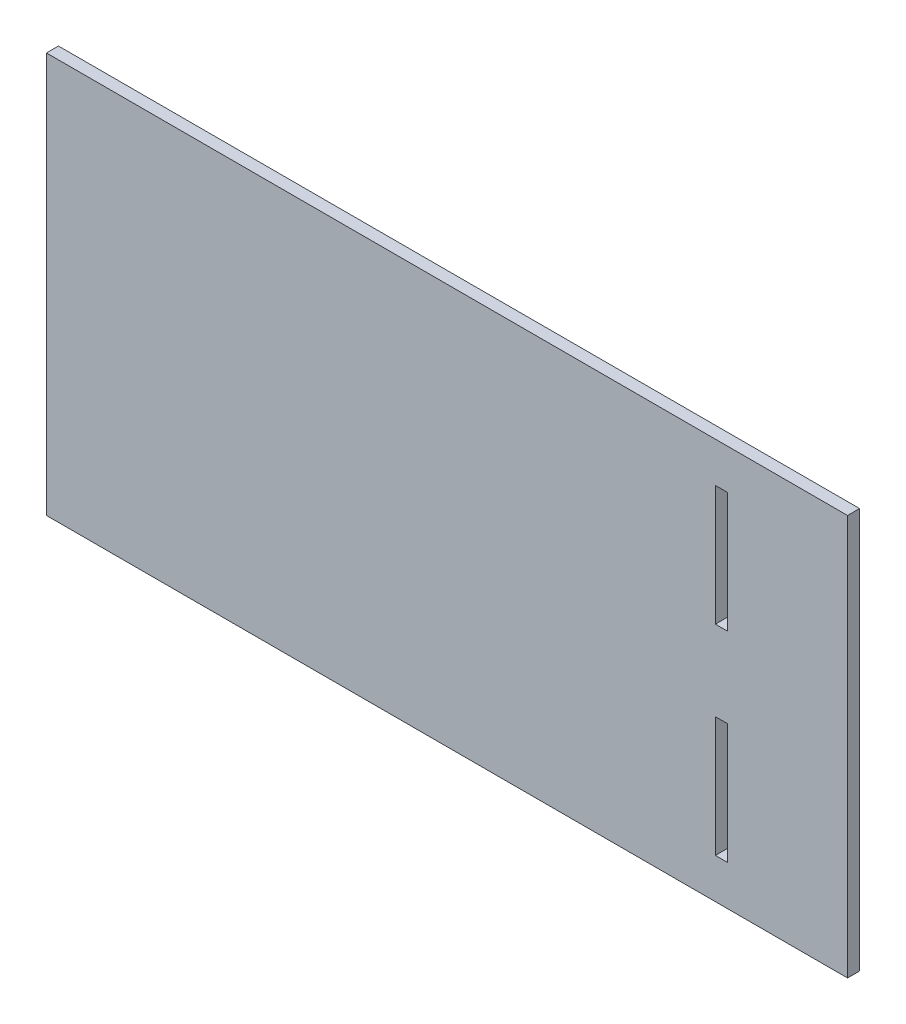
ISO-10303-21;
HEADER;
FILE_DESCRIPTION(('STEP AP214'),'2;1');
FILE_NAME('part.step','',(''),(''),'','','');
FILE_SCHEMA(('AUTOMOTIVE_DESIGN { 1 0 10303 214 1 1 1 1 }'));
ENDSEC;
DATA;
#1=APPLICATION_CONTEXT('core data for automotive mechanical design processes');
#2=APPLICATION_PROTOCOL_DEFINITION('international standard','automotive_design',2000,#1);
#3=PRODUCT_CONTEXT('',#1,'mechanical');
#4=PRODUCT('Part','Part','',(#3));
#5=PRODUCT_RELATED_PRODUCT_CATEGORY('part','',(#4));
#6=PRODUCT_DEFINITION_FORMATION('','',#4);
#7=PRODUCT_DEFINITION_CONTEXT('part definition',#1,'design');
#8=PRODUCT_DEFINITION('design','',#6,#7);
#9=PRODUCT_DEFINITION_SHAPE('','',#8);
#10=(LENGTH_UNIT() NAMED_UNIT(*) SI_UNIT(.MILLI.,.METRE.));
#11=(NAMED_UNIT(*) PLANE_ANGLE_UNIT() SI_UNIT($,.RADIAN.));
#12=(NAMED_UNIT(*) SI_UNIT($,.STERADIAN.) SOLID_ANGLE_UNIT());
#13=UNCERTAINTY_MEASURE_WITH_UNIT(LENGTH_MEASURE(1.E-05),#10,'distance_accuracy_value','');
#14=(GEOMETRIC_REPRESENTATION_CONTEXT(3) GLOBAL_UNCERTAINTY_ASSIGNED_CONTEXT((#13)) GLOBAL_UNIT_ASSIGNED_CONTEXT((#10,
#11,#12)) REPRESENTATION_CONTEXT('',''));
#15=CARTESIAN_POINT('',(0.,0.,0.));
#16=DIRECTION('',(0.,0.,1.));
#17=DIRECTION('',(1.,0.,0.));
#18=AXIS2_PLACEMENT_3D('',#15,#16,#17);
#19=CARTESIAN_POINT('',(100.,-50.,3.));
#20=DIRECTION('',(-1.,0.,0.));
#21=DIRECTION('',(0.,0.,1.));
#22=AXIS2_PLACEMENT_3D('',#19,#20,#21);
#23=PLANE('',#22);
#24=DIRECTION('',(0.,1.,0.));
#25=VECTOR('',#24,1.);
#26=CARTESIAN_POINT('',(100.,-50.,0.));
#27=LINE('',#26,#25);
#28=CARTESIAN_POINT('',(100.,-50.,0.));
#29=VERTEX_POINT('',#28);
#30=CARTESIAN_POINT('',(100.,50.,0.));
#31=VERTEX_POINT('',#30);
#32=EDGE_CURVE('E183',#29,#31,#27,.T.);
#33=ORIENTED_EDGE('',*,*,#32,.T.);
#34=DIRECTION('',(0.,0.,-1.));
#35=VECTOR('',#34,1.);
#36=CARTESIAN_POINT('',(100.,50.,3.));
#37=LINE('',#36,#35);
#38=CARTESIAN_POINT('',(100.,50.,3.));
#39=VERTEX_POINT('',#38);
#40=EDGE_CURVE('E11',#39,#31,#37,.T.);
#41=ORIENTED_EDGE('',*,*,#40,.F.);
#42=DIRECTION('',(0.,1.,0.));
#43=VECTOR('',#42,1.);
#44=CARTESIAN_POINT('',(100.,-50.,3.));
#45=LINE('',#44,#43);
#46=CARTESIAN_POINT('',(100.,-50.,3.));
#47=VERTEX_POINT('',#46);
#48=EDGE_CURVE('E190',#47,#39,#45,.T.);
#49=ORIENTED_EDGE('',*,*,#48,.F.);
#50=DIRECTION('',(0.,0.,-1.));
#51=VECTOR('',#50,1.);
#52=CARTESIAN_POINT('',(100.,-50.,3.));
#53=LINE('',#52,#51);
#54=EDGE_CURVE('E200',#47,#29,#53,.T.);
#55=ORIENTED_EDGE('',*,*,#54,.T.);
#56=EDGE_LOOP('',(#33,#41,#49,#55));
#57=FACE_BOUND('',#56,.T.);
#58=ADVANCED_FACE('F33',(#57),#23,.F.);
#59=CARTESIAN_POINT('',(-100.,50.,3.));
#60=DIRECTION('',(0.,-1.,0.));
#61=DIRECTION('',(0.,0.,-1.));
#62=AXIS2_PLACEMENT_3D('',#59,#60,#61);
#63=PLANE('',#62);
#64=DIRECTION('',(-1.,0.,0.));
#65=VECTOR('',#64,1.);
#66=CARTESIAN_POINT('',(-100.,50.,0.));
#67=LINE('',#66,#65);
#68=CARTESIAN_POINT('',(-100.,50.,0.));
#69=VERTEX_POINT('',#68);
#70=EDGE_CURVE('E203',#31,#69,#67,.T.);
#71=ORIENTED_EDGE('',*,*,#70,.T.);
#72=DIRECTION('',(0.,0.,-1.));
#73=VECTOR('',#72,1.);
#74=CARTESIAN_POINT('',(-100.,50.,3.));
#75=LINE('',#74,#73);
#76=CARTESIAN_POINT('',(-100.,50.,3.));
#77=VERTEX_POINT('',#76);
#78=EDGE_CURVE('E40',#77,#69,#75,.T.);
#79=ORIENTED_EDGE('',*,*,#78,.F.);
#80=DIRECTION('',(-1.,0.,0.));
#81=VECTOR('',#80,1.);
#82=CARTESIAN_POINT('',(-100.,50.,3.));
#83=LINE('',#82,#81);
#84=EDGE_CURVE('E193',#39,#77,#83,.T.);
#85=ORIENTED_EDGE('',*,*,#84,.F.);
#86=ORIENTED_EDGE('',*,*,#40,.T.);
#87=EDGE_LOOP('',(#71,#79,#85,#86));
#88=FACE_BOUND('',#87,.T.);
#89=ADVANCED_FACE('F232',(#88),#63,.F.);
#90=CARTESIAN_POINT('',(-100.,-50.,3.));
#91=DIRECTION('',(1.,0.,0.));
#92=DIRECTION('',(0.,0.,-1.));
#93=AXIS2_PLACEMENT_3D('',#90,#91,#92);
#94=PLANE('',#93);
#95=DIRECTION('',(0.,-1.,0.));
#96=VECTOR('',#95,1.);
#97=CARTESIAN_POINT('',(-100.,-50.,0.));
#98=LINE('',#97,#96);
#99=CARTESIAN_POINT('',(-100.,-50.,0.));
#100=VERTEX_POINT('',#99);
#101=EDGE_CURVE('E205',#69,#100,#98,.T.);
#102=ORIENTED_EDGE('',*,*,#101,.T.);
#103=DIRECTION('',(0.,0.,-1.));
#104=VECTOR('',#103,1.);
#105=CARTESIAN_POINT('',(-100.,-50.,3.));
#106=LINE('',#105,#104);
#107=CARTESIAN_POINT('',(-100.,-50.,3.));
#108=VERTEX_POINT('',#107);
#109=EDGE_CURVE('E210',#108,#100,#106,.T.);
#110=ORIENTED_EDGE('',*,*,#109,.F.);
#111=DIRECTION('',(0.,-1.,0.));
#112=VECTOR('',#111,1.);
#113=CARTESIAN_POINT('',(-100.,-50.,3.));
#114=LINE('',#113,#112);
#115=EDGE_CURVE('E196',#77,#108,#114,.T.);
#116=ORIENTED_EDGE('',*,*,#115,.F.);
#117=ORIENTED_EDGE('',*,*,#78,.T.);
#118=EDGE_LOOP('',(#102,#110,#116,#117));
#119=FACE_BOUND('',#118,.T.);
#120=ADVANCED_FACE('F217',(#119),#94,.F.);
#121=CARTESIAN_POINT('',(-100.,-50.,3.));
#122=DIRECTION('',(0.,1.,0.));
#123=DIRECTION('',(0.,0.,1.));
#124=AXIS2_PLACEMENT_3D('',#121,#122,#123);
#125=PLANE('',#124);
#126=DIRECTION('',(1.,0.,0.));
#127=VECTOR('',#126,1.);
#128=CARTESIAN_POINT('',(-100.,-50.,0.));
#129=LINE('',#128,#127);
#130=EDGE_CURVE('E194',#100,#29,#129,.T.);
#131=ORIENTED_EDGE('',*,*,#130,.T.);
#132=ORIENTED_EDGE('',*,*,#54,.F.);
#133=DIRECTION('',(1.,0.,0.));
#134=VECTOR('',#133,1.);
#135=CARTESIAN_POINT('',(-100.,-50.,3.));
#136=LINE('',#135,#134);
#137=EDGE_CURVE('E198',#108,#47,#136,.T.);
#138=ORIENTED_EDGE('',*,*,#137,.F.);
#139=ORIENTED_EDGE('',*,*,#109,.T.);
#140=EDGE_LOOP('',(#131,#132,#138,#139));
#141=FACE_BOUND('',#140,.T.);
#142=ADVANCED_FACE('F225',(#141),#125,.F.);
#143=CARTESIAN_POINT('',(0.,0.,3.));
#144=DIRECTION('',(0.,0.,-1.));
#145=DIRECTION('',(-1.,0.,0.));
#146=AXIS2_PLACEMENT_3D('',#143,#144,#145);
#147=PLANE('',#146);
#148=DIRECTION('',(1.,0.,0.));
#149=VECTOR('',#148,1.);
#150=CARTESIAN_POINT('',(67.,9.99999999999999,3.));
#151=LINE('',#150,#149);
#152=CARTESIAN_POINT('',(67.,9.99999999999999,3.));
#153=VERTEX_POINT('',#152);
#154=CARTESIAN_POINT('',(70.,9.99999999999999,3.));
#155=VERTEX_POINT('',#154);
#156=EDGE_CURVE('E148',#153,#155,#151,.T.);
#157=ORIENTED_EDGE('',*,*,#156,.F.);
#158=DIRECTION('',(0.,-1.,0.));
#159=VECTOR('',#158,1.);
#160=CARTESIAN_POINT('',(67.,40.,3.));
#161=LINE('',#160,#159);
#162=CARTESIAN_POINT('',(67.,40.,3.));
#163=VERTEX_POINT('',#162);
#164=EDGE_CURVE('E47',#163,#153,#161,.T.);
#165=ORIENTED_EDGE('',*,*,#164,.F.);
#166=DIRECTION('',(-1.,0.,0.));
#167=VECTOR('',#166,1.);
#168=CARTESIAN_POINT('',(67.,40.,3.));
#169=LINE('',#168,#167);
#170=CARTESIAN_POINT('',(70.,40.,3.));
#171=VERTEX_POINT('',#170);
#172=EDGE_CURVE('E139',#171,#163,#169,.T.);
#173=ORIENTED_EDGE('',*,*,#172,.F.);
#174=DIRECTION('',(0.,1.,0.));
#175=VECTOR('',#174,1.);
#176=CARTESIAN_POINT('',(70.,40.,3.));
#177=LINE('',#176,#175);
#178=EDGE_CURVE('E142',#155,#171,#177,.T.);
#179=ORIENTED_EDGE('',*,*,#178,.F.);
#180=EDGE_LOOP('',(#157,#165,#173,#179));
#181=FACE_BOUND('',#180,.T.);
#182=DIRECTION('',(-1.,0.,0.));
#183=VECTOR('',#182,1.);
#184=CARTESIAN_POINT('',(67.,-10.,3.));
#185=LINE('',#184,#183);
#186=CARTESIAN_POINT('',(70.,-10.,3.));
#187=VERTEX_POINT('',#186);
#188=CARTESIAN_POINT('',(67.,-10.,3.));
#189=VERTEX_POINT('',#188);
#190=EDGE_CURVE('E173',#187,#189,#185,.T.);
#191=ORIENTED_EDGE('',*,*,#190,.F.);
#192=DIRECTION('',(0.,1.,0.));
#193=VECTOR('',#192,1.);
#194=CARTESIAN_POINT('',(70.,-40.,3.));
#195=LINE('',#194,#193);
#196=CARTESIAN_POINT('',(70.,-40.,3.));
#197=VERTEX_POINT('',#196);
#198=EDGE_CURVE('E154',#197,#187,#195,.T.);
#199=ORIENTED_EDGE('',*,*,#198,.F.);
#200=DIRECTION('',(1.,0.,0.));
#201=VECTOR('',#200,1.);
#202=CARTESIAN_POINT('',(67.,-40.,3.));
#203=LINE('',#202,#201);
#204=CARTESIAN_POINT('',(67.,-40.,3.));
#205=VERTEX_POINT('',#204);
#206=EDGE_CURVE('E162',#205,#197,#203,.T.);
#207=ORIENTED_EDGE('',*,*,#206,.F.);
#208=DIRECTION('',(0.,-1.,0.));
#209=VECTOR('',#208,1.);
#210=CARTESIAN_POINT('',(67.,-40.,3.));
#211=LINE('',#210,#209);
#212=EDGE_CURVE('E176',#189,#205,#211,.T.);
#213=ORIENTED_EDGE('',*,*,#212,.F.);
#214=EDGE_LOOP('',(#191,#199,#207,#213));
#215=FACE_BOUND('',#214,.T.);
#216=ORIENTED_EDGE('',*,*,#48,.T.);
#217=ORIENTED_EDGE('',*,*,#84,.T.);
#218=ORIENTED_EDGE('',*,*,#115,.T.);
#219=ORIENTED_EDGE('',*,*,#137,.T.);
#220=EDGE_LOOP('',(#216,#217,#218,#219));
#221=FACE_BOUND('',#220,.T.);
#222=ADVANCED_FACE('F231',(#181,#215,#221),#147,.F.);
#223=CARTESIAN_POINT('',(0.,0.,0.));
#224=DIRECTION('',(0.,0.,-1.));
#225=DIRECTION('',(-1.,0.,0.));
#226=AXIS2_PLACEMENT_3D('',#223,#224,#225);
#227=PLANE('',#226);
#228=DIRECTION('',(0.,-1.,0.));
#229=VECTOR('',#228,1.);
#230=CARTESIAN_POINT('',(67.,40.,0.));
#231=LINE('',#230,#229);
#232=CARTESIAN_POINT('',(67.,40.,0.));
#233=VERTEX_POINT('',#232);
#234=CARTESIAN_POINT('',(67.,9.99999999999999,0.));
#235=VERTEX_POINT('',#234);
#236=EDGE_CURVE('E123',#233,#235,#231,.T.);
#237=ORIENTED_EDGE('',*,*,#236,.T.);
#238=DIRECTION('',(1.,0.,0.));
#239=VECTOR('',#238,1.);
#240=CARTESIAN_POINT('',(67.,9.99999999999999,0.));
#241=LINE('',#240,#239);
#242=CARTESIAN_POINT('',(70.,9.99999999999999,0.));
#243=VERTEX_POINT('',#242);
#244=EDGE_CURVE('E132',#235,#243,#241,.T.);
#245=ORIENTED_EDGE('',*,*,#244,.T.);
#246=DIRECTION('',(0.,1.,0.));
#247=VECTOR('',#246,1.);
#248=CARTESIAN_POINT('',(70.,40.,0.));
#249=LINE('',#248,#247);
#250=CARTESIAN_POINT('',(70.,40.,0.));
#251=VERTEX_POINT('',#250);
#252=EDGE_CURVE('E55',#243,#251,#249,.T.);
#253=ORIENTED_EDGE('',*,*,#252,.T.);
#254=DIRECTION('',(-1.,0.,0.));
#255=VECTOR('',#254,1.);
#256=CARTESIAN_POINT('',(67.,40.,0.));
#257=LINE('',#256,#255);
#258=EDGE_CURVE('E129',#251,#233,#257,.T.);
#259=ORIENTED_EDGE('',*,*,#258,.T.);
#260=EDGE_LOOP('',(#237,#245,#253,#259));
#261=FACE_BOUND('',#260,.T.);
#262=DIRECTION('',(0.,1.,0.));
#263=VECTOR('',#262,1.);
#264=CARTESIAN_POINT('',(70.,-40.,0.));
#265=LINE('',#264,#263);
#266=CARTESIAN_POINT('',(70.,-40.,0.));
#267=VERTEX_POINT('',#266);
#268=CARTESIAN_POINT('',(70.,-10.,0.));
#269=VERTEX_POINT('',#268);
#270=EDGE_CURVE('E158',#267,#269,#265,.T.);
#271=ORIENTED_EDGE('',*,*,#270,.T.);
#272=DIRECTION('',(-1.,0.,0.));
#273=VECTOR('',#272,1.);
#274=CARTESIAN_POINT('',(67.,-10.,0.));
#275=LINE('',#274,#273);
#276=CARTESIAN_POINT('',(67.,-10.,0.));
#277=VERTEX_POINT('',#276);
#278=EDGE_CURVE('E161',#269,#277,#275,.T.);
#279=ORIENTED_EDGE('',*,*,#278,.T.);
#280=DIRECTION('',(0.,-1.,0.));
#281=VECTOR('',#280,1.);
#282=CARTESIAN_POINT('',(67.,-40.,0.));
#283=LINE('',#282,#281);
#284=CARTESIAN_POINT('',(67.,-40.,0.));
#285=VERTEX_POINT('',#284);
#286=EDGE_CURVE('E165',#277,#285,#283,.T.);
#287=ORIENTED_EDGE('',*,*,#286,.T.);
#288=DIRECTION('',(1.,0.,0.));
#289=VECTOR('',#288,1.);
#290=CARTESIAN_POINT('',(67.,-40.,0.));
#291=LINE('',#290,#289);
#292=EDGE_CURVE('E168',#285,#267,#291,.T.);
#293=ORIENTED_EDGE('',*,*,#292,.T.);
#294=EDGE_LOOP('',(#271,#279,#287,#293));
#295=FACE_BOUND('',#294,.T.);
#296=ORIENTED_EDGE('',*,*,#32,.F.);
#297=ORIENTED_EDGE('',*,*,#130,.F.);
#298=ORIENTED_EDGE('',*,*,#101,.F.);
#299=ORIENTED_EDGE('',*,*,#70,.F.);
#300=EDGE_LOOP('',(#296,#297,#298,#299));
#301=FACE_BOUND('',#300,.T.);
#302=ADVANCED_FACE('F136',(#261,#295,#301),#227,.T.);
#303=CARTESIAN_POINT('',(70.,-40.,0.));
#304=DIRECTION('',(1.,0.,0.));
#305=DIRECTION('',(0.,0.,-1.));
#306=AXIS2_PLACEMENT_3D('',#303,#304,#305);
#307=PLANE('',#306);
#308=ORIENTED_EDGE('',*,*,#198,.T.);
#309=DIRECTION('',(0.,0.,1.));
#310=VECTOR('',#309,1.);
#311=CARTESIAN_POINT('',(70.,-10.,0.));
#312=LINE('',#311,#310);
#313=EDGE_CURVE('E171',#269,#187,#312,.T.);
#314=ORIENTED_EDGE('',*,*,#313,.F.);
#315=ORIENTED_EDGE('',*,*,#270,.F.);
#316=DIRECTION('',(0.,0.,1.));
#317=VECTOR('',#316,1.);
#318=CARTESIAN_POINT('',(70.,-40.,0.));
#319=LINE('',#318,#317);
#320=EDGE_CURVE('E181',#267,#197,#319,.T.);
#321=ORIENTED_EDGE('',*,*,#320,.T.);
#322=EDGE_LOOP('',(#308,#314,#315,#321));
#323=FACE_BOUND('',#322,.T.);
#324=ADVANCED_FACE('F244',(#323),#307,.F.);
#325=CARTESIAN_POINT('',(67.,-40.,0.));
#326=DIRECTION('',(0.,-1.,0.));
#327=DIRECTION('',(1.,0.,0.));
#328=AXIS2_PLACEMENT_3D('',#325,#326,#327);
#329=PLANE('',#328);
#330=ORIENTED_EDGE('',*,*,#206,.T.);
#331=ORIENTED_EDGE('',*,*,#320,.F.);
#332=ORIENTED_EDGE('',*,*,#292,.F.);
#333=DIRECTION('',(0.,0.,1.));
#334=VECTOR('',#333,1.);
#335=CARTESIAN_POINT('',(67.,-40.,0.));
#336=LINE('',#335,#334);
#337=EDGE_CURVE('E184',#285,#205,#336,.T.);
#338=ORIENTED_EDGE('',*,*,#337,.T.);
#339=EDGE_LOOP('',(#330,#331,#332,#338));
#340=FACE_BOUND('',#339,.T.);
#341=ADVANCED_FACE('F250',(#340),#329,.F.);
#342=CARTESIAN_POINT('',(67.,-40.,0.));
#343=DIRECTION('',(-1.,0.,0.));
#344=DIRECTION('',(0.,0.,1.));
#345=AXIS2_PLACEMENT_3D('',#342,#343,#344);
#346=PLANE('',#345);
#347=ORIENTED_EDGE('',*,*,#212,.T.);
#348=ORIENTED_EDGE('',*,*,#337,.F.);
#349=ORIENTED_EDGE('',*,*,#286,.F.);
#350=DIRECTION('',(0.,0.,1.));
#351=VECTOR('',#350,1.);
#352=CARTESIAN_POINT('',(67.,-10.,0.));
#353=LINE('',#352,#351);
#354=EDGE_CURVE('E186',#277,#189,#353,.T.);
#355=ORIENTED_EDGE('',*,*,#354,.T.);
#356=EDGE_LOOP('',(#347,#348,#349,#355));
#357=FACE_BOUND('',#356,.T.);
#358=ADVANCED_FACE('F255',(#357),#346,.F.);
#359=CARTESIAN_POINT('',(67.,-10.,0.));
#360=DIRECTION('',(0.,1.,0.));
#361=DIRECTION('',(0.,0.,1.));
#362=AXIS2_PLACEMENT_3D('',#359,#360,#361);
#363=PLANE('',#362);
#364=ORIENTED_EDGE('',*,*,#190,.T.);
#365=ORIENTED_EDGE('',*,*,#354,.F.);
#366=ORIENTED_EDGE('',*,*,#278,.F.);
#367=ORIENTED_EDGE('',*,*,#313,.T.);
#368=EDGE_LOOP('',(#364,#365,#366,#367));
#369=FACE_BOUND('',#368,.T.);
#370=ADVANCED_FACE('F252',(#369),#363,.F.);
#371=CARTESIAN_POINT('',(67.,40.,0.));
#372=DIRECTION('',(-1.,0.,0.));
#373=DIRECTION('',(0.,0.,1.));
#374=AXIS2_PLACEMENT_3D('',#371,#372,#373);
#375=PLANE('',#374);
#376=ORIENTED_EDGE('',*,*,#164,.T.);
#377=DIRECTION('',(0.,0.,1.));
#378=VECTOR('',#377,1.);
#379=CARTESIAN_POINT('',(67.,9.99999999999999,0.));
#380=LINE('',#379,#378);
#381=EDGE_CURVE('E119',#235,#153,#380,.T.);
#382=ORIENTED_EDGE('',*,*,#381,.F.);
#383=ORIENTED_EDGE('',*,*,#236,.F.);
#384=DIRECTION('',(0.,0.,1.));
#385=VECTOR('',#384,1.);
#386=CARTESIAN_POINT('',(67.,40.,0.));
#387=LINE('',#386,#385);
#388=EDGE_CURVE('E152',#233,#163,#387,.T.);
#389=ORIENTED_EDGE('',*,*,#388,.T.);
#390=EDGE_LOOP('',(#376,#382,#383,#389));
#391=FACE_BOUND('',#390,.T.);
#392=ADVANCED_FACE('F121',(#391),#375,.F.);
#393=CARTESIAN_POINT('',(67.,40.,0.));
#394=DIRECTION('',(0.,1.,0.));
#395=DIRECTION('',(-1.,0.,0.));
#396=AXIS2_PLACEMENT_3D('',#393,#394,#395);
#397=PLANE('',#396);
#398=ORIENTED_EDGE('',*,*,#172,.T.);
#399=ORIENTED_EDGE('',*,*,#388,.F.);
#400=ORIENTED_EDGE('',*,*,#258,.F.);
#401=DIRECTION('',(0.,0.,1.));
#402=VECTOR('',#401,1.);
#403=CARTESIAN_POINT('',(70.,40.,0.));
#404=LINE('',#403,#402);
#405=EDGE_CURVE('E155',#251,#171,#404,.T.);
#406=ORIENTED_EDGE('',*,*,#405,.T.);
#407=EDGE_LOOP('',(#398,#399,#400,#406));
#408=FACE_BOUND('',#407,.T.);
#409=ADVANCED_FACE('F265',(#408),#397,.F.);
#410=CARTESIAN_POINT('',(70.,40.,0.));
#411=DIRECTION('',(1.,0.,0.));
#412=DIRECTION('',(0.,0.,-1.));
#413=AXIS2_PLACEMENT_3D('',#410,#411,#412);
#414=PLANE('',#413);
#415=ORIENTED_EDGE('',*,*,#178,.T.);
#416=ORIENTED_EDGE('',*,*,#405,.F.);
#417=ORIENTED_EDGE('',*,*,#252,.F.);
#418=DIRECTION('',(0.,0.,1.));
#419=VECTOR('',#418,1.);
#420=CARTESIAN_POINT('',(70.,9.99999999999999,0.));
#421=LINE('',#420,#419);
#422=EDGE_CURVE('E128',#243,#155,#421,.T.);
#423=ORIENTED_EDGE('',*,*,#422,.T.);
#424=EDGE_LOOP('',(#415,#416,#417,#423));
#425=FACE_BOUND('',#424,.T.);
#426=ADVANCED_FACE('F268',(#425),#414,.F.);
#427=CARTESIAN_POINT('',(67.,9.99999999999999,0.));
#428=DIRECTION('',(0.,-1.,0.));
#429=DIRECTION('',(0.,0.,-1.));
#430=AXIS2_PLACEMENT_3D('',#427,#428,#429);
#431=PLANE('',#430);
#432=ORIENTED_EDGE('',*,*,#156,.T.);
#433=ORIENTED_EDGE('',*,*,#422,.F.);
#434=ORIENTED_EDGE('',*,*,#244,.F.);
#435=ORIENTED_EDGE('',*,*,#381,.T.);
#436=EDGE_LOOP('',(#432,#433,#434,#435));
#437=FACE_BOUND('',#436,.T.);
#438=ADVANCED_FACE('F133',(#437),#431,.F.);
#439=CLOSED_SHELL('',(#58,#89,#120,#142,#222,#302,#324,#341,#358,#370,#392,#409,#426,#438));
#440=MANIFOLD_SOLID_BREP('B2',#439);
#441=ADVANCED_BREP_SHAPE_REPRESENTATION('',(#18,#440),#14);
#442=SHAPE_DEFINITION_REPRESENTATION(#9,#441);
ENDSEC;
END-ISO-10303-21;
